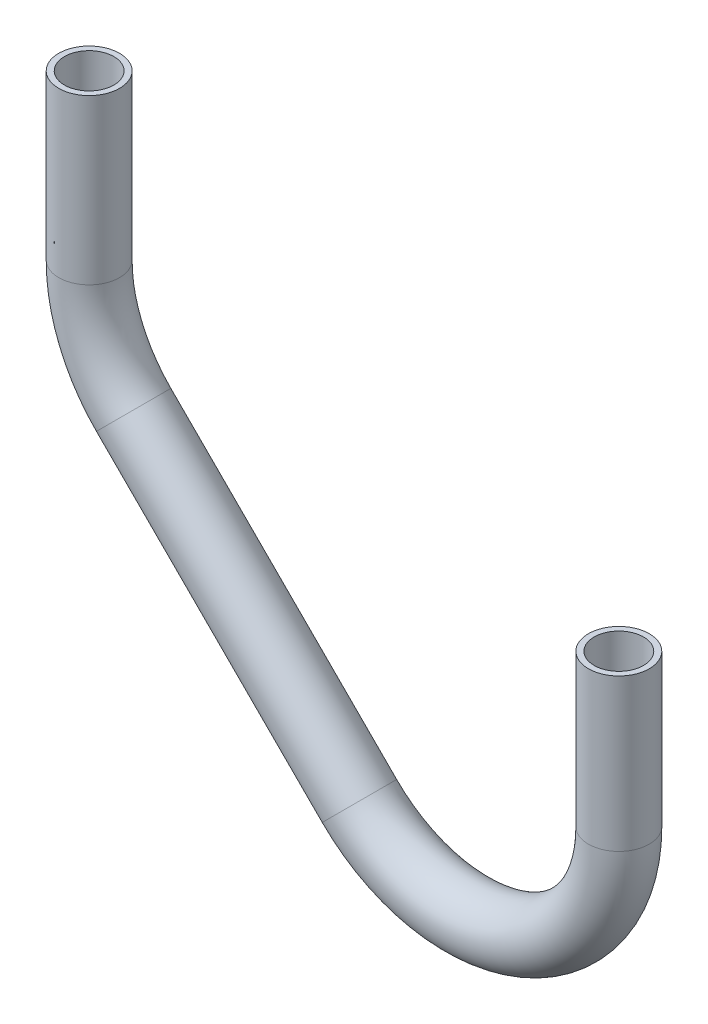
ISO-10303-21;
HEADER;
FILE_DESCRIPTION(('STEP AP214'),'2;1');
FILE_NAME('part.step','',(''),(''),'','','');
FILE_SCHEMA(('AUTOMOTIVE_DESIGN { 1 0 10303 214 1 1 1 1 }'));
ENDSEC;
DATA;
#1=APPLICATION_CONTEXT('core data for automotive mechanical design processes');
#2=APPLICATION_PROTOCOL_DEFINITION('international standard','automotive_design',2000,#1);
#3=PRODUCT_CONTEXT('',#1,'mechanical');
#4=PRODUCT('Part','Part','',(#3));
#5=PRODUCT_RELATED_PRODUCT_CATEGORY('part','',(#4));
#6=PRODUCT_DEFINITION_FORMATION('','',#4);
#7=PRODUCT_DEFINITION_CONTEXT('part definition',#1,'design');
#8=PRODUCT_DEFINITION('design','',#6,#7);
#9=PRODUCT_DEFINITION_SHAPE('','',#8);
#10=(LENGTH_UNIT() NAMED_UNIT(*) SI_UNIT(.MILLI.,.METRE.));
#11=(NAMED_UNIT(*) PLANE_ANGLE_UNIT() SI_UNIT($,.RADIAN.));
#12=(NAMED_UNIT(*) SI_UNIT($,.STERADIAN.) SOLID_ANGLE_UNIT());
#13=UNCERTAINTY_MEASURE_WITH_UNIT(LENGTH_MEASURE(1.E-05),#10,'distance_accuracy_value','');
#14=(GEOMETRIC_REPRESENTATION_CONTEXT(3) GLOBAL_UNCERTAINTY_ASSIGNED_CONTEXT((#13)) GLOBAL_UNIT_ASSIGNED_CONTEXT((#10,
#11,#12)) REPRESENTATION_CONTEXT('',''));
#15=CARTESIAN_POINT('',(0.,0.,0.));
#16=DIRECTION('',(0.,0.,1.));
#17=DIRECTION('',(1.,0.,0.));
#18=AXIS2_PLACEMENT_3D('',#15,#16,#17);
#19=CARTESIAN_POINT('',(0.,0.,0.));
#20=DIRECTION('',(0.,-0.999999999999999,0.));
#21=DIRECTION('',(0.999999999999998,0.,0.));
#22=AXIS2_PLACEMENT_3D('',#19,#20,#21);
#23=CYLINDRICAL_SURFACE('',#22,4.7625);
#24=CARTESIAN_POINT('',(0.,-23.8124999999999,0.));
#25=DIRECTION('',(0.,1.,0.));
#26=DIRECTION('',(0.,0.,0.999999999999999));
#27=AXIS2_PLACEMENT_3D('',#24,#25,#26);
#28=CIRCLE('',#27,4.7625);
#29=CARTESIAN_POINT('',(4.76250000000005,-23.8124999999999,0.));
#30=VERTEX_POINT('',#29);
#31=EDGE_CURVE('E113',#30,#30,#28,.T.);
#32=ORIENTED_EDGE('',*,*,#31,.T.);
#33=EDGE_LOOP('',(#32));
#34=FACE_BOUND('',#33,.T.);
#35=CARTESIAN_POINT('',(0.,0.,0.));
#36=DIRECTION('',(0.,1.,0.));
#37=DIRECTION('',(0.,0.,0.999999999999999));
#38=AXIS2_PLACEMENT_3D('',#35,#36,#37);
#39=CIRCLE('',#38,4.7625);
#40=CARTESIAN_POINT('',(0.,0.,4.7625));
#41=VERTEX_POINT('',#40);
#42=EDGE_CURVE('E47',#41,#41,#39,.T.);
#43=ORIENTED_EDGE('',*,*,#42,.F.);
#44=EDGE_LOOP('',(#43));
#45=FACE_BOUND('',#44,.T.);
#46=ADVANCED_FACE('F32',(#34,#45),#23,.T.);
#47=CARTESIAN_POINT('',(-23.8125,-23.8125,0.));
#48=DIRECTION('',(0.,0.,-0.999999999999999));
#49=DIRECTION('',(-0.999999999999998,0.,0.));
#50=AXIS2_PLACEMENT_3D('',#47,#48,#49);
#51=TOROIDAL_SURFACE('',#50,23.8125,4.7625);
#52=CARTESIAN_POINT('',(-40.6504802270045,-40.6504802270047,0.));
#53=DIRECTION('',(0.707106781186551,-0.707106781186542,0.));
#54=DIRECTION('',(0.,0.,0.999999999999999));
#55=AXIS2_PLACEMENT_3D('',#52,#53,#54);
#56=CIRCLE('',#55,4.7625);
#57=CARTESIAN_POINT('',(-44.0180762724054,-44.0180762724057,0.));
#58=VERTEX_POINT('',#57);
#59=EDGE_CURVE('E116',#58,#58,#56,.T.);
#60=CARTESIAN_POINT('',(-23.8125,-23.8125,0.));
#61=DIRECTION('',(0.,0.,-0.999999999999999));
#62=DIRECTION('',(-0.999999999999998,0.,0.));
#63=AXIS2_PLACEMENT_3D('',#60,#61,#62);
#64=CIRCLE('',#63,28.575);
#65=EDGE_CURVE('',#30,#58,#64,.T.);
#66=ORIENTED_EDGE('',*,*,#31,.F.);
#67=ORIENTED_EDGE('',*,*,#59,.T.);
#68=ORIENTED_EDGE('',*,*,#65,.T.);
#69=ORIENTED_EDGE('',*,*,#65,.F.);
#70=EDGE_LOOP('',(#66,#68,#67,#69));
#71=FACE_BOUND('',#70,.T.);
#72=ADVANCED_FACE('F137',(#71),#51,.T.);
#73=CARTESIAN_POINT('',(-40.6504802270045,-40.6504802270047,0.));
#74=DIRECTION('',(-0.707106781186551,0.707106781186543,0.));
#75=DIRECTION('',(-0.707106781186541,-0.707106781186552,0.));
#76=AXIS2_PLACEMENT_3D('',#73,#74,#75);
#77=CYLINDRICAL_SURFACE('',#76,4.7625);
#78=CARTESIAN_POINT('',(-76.0373473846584,-5.26361306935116,0.));
#79=DIRECTION('',(0.707106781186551,-0.707106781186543,0.));
#80=DIRECTION('',(0.,0.,0.999999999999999));
#81=AXIS2_PLACEMENT_3D('',#78,#79,#80);
#82=CIRCLE('',#81,4.7625);
#83=CARTESIAN_POINT('',(-79.4049434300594,-8.63120911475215,0.));
#84=VERTEX_POINT('',#83);
#85=EDGE_CURVE('E118',#84,#84,#82,.T.);
#86=CARTESIAN_POINT('',(-79.4049434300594,-8.63120911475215,0.));
#87=CARTESIAN_POINT('',(-79.0363302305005,-8.99982231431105,0.));
#88=CARTESIAN_POINT('',(-78.6677170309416,-9.36843551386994,0.));
#89=CARTESIAN_POINT('',(-77.9304906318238,-10.1056619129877,0.));
#90=CARTESIAN_POINT('',(-77.5618774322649,-10.4742751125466,0.));
#91=CARTESIAN_POINT('',(-76.8246510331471,-11.2115015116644,0.));
#92=CARTESIAN_POINT('',(-76.4560378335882,-11.5801147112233,0.));
#93=CARTESIAN_POINT('',(-75.7188114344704,-12.3173411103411,0.));
#94=CARTESIAN_POINT('',(-75.3501982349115,-12.6859543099,0.));
#95=CARTESIAN_POINT('',(-74.6129718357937,-13.4231807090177,0.));
#96=CARTESIAN_POINT('',(-74.2443586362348,-13.7917939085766,0.));
#97=CARTESIAN_POINT('',(-73.507132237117,-14.5290203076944,0.));
#98=CARTESIAN_POINT('',(-73.1385190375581,-14.8976335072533,0.));
#99=CARTESIAN_POINT('',(-72.4012926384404,-15.6348599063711,0.));
#100=CARTESIAN_POINT('',(-72.0326794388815,-16.00347310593,0.));
#101=CARTESIAN_POINT('',(-71.2954530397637,-16.7406995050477,0.));
#102=CARTESIAN_POINT('',(-70.9268398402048,-17.1093127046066,0.));
#103=CARTESIAN_POINT('',(-70.189613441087,-17.8465391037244,0.));
#104=CARTESIAN_POINT('',(-69.8210002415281,-18.2151523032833,0.));
#105=CARTESIAN_POINT('',(-69.0837738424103,-18.9523787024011,0.));
#106=CARTESIAN_POINT('',(-68.7151606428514,-19.32099190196,0.));
#107=CARTESIAN_POINT('',(-67.9779342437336,-20.0582183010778,0.));
#108=CARTESIAN_POINT('',(-67.6093210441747,-20.4268315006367,0.));
#109=CARTESIAN_POINT('',(-66.8720946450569,-21.1640578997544,0.));
#110=CARTESIAN_POINT('',(-66.503481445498,-21.5326710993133,0.));
#111=CARTESIAN_POINT('',(-65.7662550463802,-22.2698974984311,0.));
#112=CARTESIAN_POINT('',(-65.3976418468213,-22.63851069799,0.));
#113=CARTESIAN_POINT('',(-64.6604154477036,-23.3757370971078,0.));
#114=CARTESIAN_POINT('',(-64.2918022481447,-23.7443502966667,0.));
#115=CARTESIAN_POINT('',(-63.5545758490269,-24.4815766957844,0.));
#116=CARTESIAN_POINT('',(-63.185962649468,-24.8501898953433,0.));
#117=CARTESIAN_POINT('',(-62.4487362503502,-25.5874162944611,0.));
#118=CARTESIAN_POINT('',(-62.0801230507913,-25.95602949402,0.));
#119=CARTESIAN_POINT('',(-61.3428966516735,-26.6932558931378,0.));
#120=CARTESIAN_POINT('',(-60.9742834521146,-27.0618690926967,0.));
#121=CARTESIAN_POINT('',(-60.2370570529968,-27.7990954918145,0.));
#122=CARTESIAN_POINT('',(-59.8684438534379,-28.1677086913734,0.));
#123=CARTESIAN_POINT('',(-59.1312174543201,-28.9049350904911,0.));
#124=CARTESIAN_POINT('',(-58.7626042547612,-29.27354829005,0.));
#125=CARTESIAN_POINT('',(-58.0253778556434,-30.0107746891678,0.));
#126=CARTESIAN_POINT('',(-57.6567646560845,-30.3793878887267,0.));
#127=CARTESIAN_POINT('',(-56.9195382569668,-31.1166142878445,0.));
#128=CARTESIAN_POINT('',(-56.5509250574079,-31.4852274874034,0.));
#129=CARTESIAN_POINT('',(-55.8136986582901,-32.2224538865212,0.));
#130=CARTESIAN_POINT('',(-55.4450854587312,-32.59106708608,0.));
#131=CARTESIAN_POINT('',(-54.7078590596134,-33.3282934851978,0.));
#132=CARTESIAN_POINT('',(-54.3392458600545,-33.6969066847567,0.));
#133=CARTESIAN_POINT('',(-53.6020194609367,-34.4341330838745,0.));
#134=CARTESIAN_POINT('',(-53.2334062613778,-34.8027462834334,0.));
#135=CARTESIAN_POINT('',(-52.49617986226,-35.5399726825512,0.));
#136=CARTESIAN_POINT('',(-52.1275666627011,-35.9085858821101,0.));
#137=CARTESIAN_POINT('',(-51.3903402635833,-36.6458122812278,0.));
#138=CARTESIAN_POINT('',(-51.0217270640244,-37.0144254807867,0.));
#139=CARTESIAN_POINT('',(-50.2845006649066,-37.7516518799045,0.));
#140=CARTESIAN_POINT('',(-49.9158874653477,-38.1202650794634,0.));
#141=CARTESIAN_POINT('',(-49.17866106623,-38.8574914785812,0.));
#142=CARTESIAN_POINT('',(-48.8100478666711,-39.2261046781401,0.));
#143=CARTESIAN_POINT('',(-48.0728214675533,-39.9633310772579,0.));
#144=CARTESIAN_POINT('',(-47.7042082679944,-40.3319442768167,0.));
#145=CARTESIAN_POINT('',(-46.9669818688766,-41.0691706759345,0.));
#146=CARTESIAN_POINT('',(-46.5983686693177,-41.4377838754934,0.));
#147=CARTESIAN_POINT('',(-45.8611422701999,-42.1750102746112,0.));
#148=CARTESIAN_POINT('',(-45.492529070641,-42.5436234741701,0.));
#149=CARTESIAN_POINT('',(-44.7553026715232,-43.2808498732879,0.));
#150=CARTESIAN_POINT('',(-44.3866894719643,-43.6494630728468,0.));
#151=CARTESIAN_POINT('',(-44.0180762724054,-44.0180762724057,0.));
#152=B_SPLINE_CURVE_WITH_KNOTS('',3,(#86,#87,#88,#89,#90,#91,#92,#93,#94,#95,#96,#97,#98,#99,
#100,#101,#102,#103,#104,#105,#106,#107,#108,#109,#110,#111,#112,#113,#114,#115,#116,#117,#118,
#119,#120,#121,#122,#123,#124,#125,#126,#127,#128,#129,#130,#131,#132,#133,#134,#135,#136,#137,
#138,#139,#140,#141,#142,#143,#144,#145,#146,#147,#148,#149,#150,#151),.UNSPECIFIED.,.F.,.F.,(4,
2,2,2,2,2,2,2,2,2,2,2,2,2,2,2,2,2,2,2,2,2,2,2,2,2,2,2,2,2,2,2,4),(0.,1.56389335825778,
3.12778671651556,4.69168007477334,6.25557343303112,7.8194667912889,9.38336014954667,
10.9472535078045,12.5111468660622,14.07504022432,15.6389335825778,17.2028269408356,
18.7667202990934,20.3306136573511,21.8945070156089,23.4584003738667,25.0222937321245,
26.5861870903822,28.15008044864,29.7139738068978,31.2778671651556,32.8417605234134,
34.4056538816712,35.9695472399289,37.5334405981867,39.0973339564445,40.6612273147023,
42.2251206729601,43.7890140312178,45.3529073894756,46.9168007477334,48.4806941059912,
50.0445874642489),.UNSPECIFIED.);
#153=EDGE_CURVE('BSEAM133',#84,#58,#152,.T.);
#154=ORIENTED_EDGE('',*,*,#85,.T.);
#155=ORIENTED_EDGE('',*,*,#59,.F.);
#156=ORIENTED_EDGE('',*,*,#153,.T.);
#157=ORIENTED_EDGE('',*,*,#153,.F.);
#158=EDGE_LOOP('',(#154,#156,#155,#157));
#159=FACE_BOUND('',#158,.T.);
#160=ADVANCED_FACE('F133',(#159),#77,.T.);
#161=CARTESIAN_POINT('',(-59.1993671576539,11.5743671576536,0.));
#162=DIRECTION('',(0.,0.,-0.999999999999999));
#163=DIRECTION('',(-0.999999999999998,0.,0.));
#164=AXIS2_PLACEMENT_3D('',#161,#162,#163);
#165=TOROIDAL_SURFACE('',#164,23.8125,4.7625);
#166=CARTESIAN_POINT('',(-83.0118671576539,11.5743671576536,0.));
#167=DIRECTION('',(0.,-0.999999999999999,0.));
#168=DIRECTION('',(0.,0.,0.999999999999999));
#169=AXIS2_PLACEMENT_3D('',#166,#167,#168);
#170=CIRCLE('',#169,4.7625);
#171=CARTESIAN_POINT('',(-87.7743671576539,11.5743671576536,0.));
#172=VERTEX_POINT('',#171);
#173=EDGE_CURVE('E36',#172,#172,#170,.T.);
#174=CARTESIAN_POINT('',(-59.1993671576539,11.5743671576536,0.));
#175=DIRECTION('',(0.,0.,-0.999999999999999));
#176=DIRECTION('',(-0.999999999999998,0.,0.));
#177=AXIS2_PLACEMENT_3D('',#174,#175,#176);
#178=CIRCLE('',#177,28.575);
#179=EDGE_CURVE('',#84,#172,#178,.T.);
#180=ORIENTED_EDGE('',*,*,#85,.F.);
#181=ORIENTED_EDGE('',*,*,#173,.T.);
#182=ORIENTED_EDGE('',*,*,#179,.T.);
#183=ORIENTED_EDGE('',*,*,#179,.F.);
#184=EDGE_LOOP('',(#180,#182,#181,#183));
#185=FACE_BOUND('',#184,.T.);
#186=ADVANCED_FACE('F125',(#185),#165,.T.);
#187=CARTESIAN_POINT('',(-83.0118671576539,11.5743671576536,0.));
#188=DIRECTION('',(0.,1.,0.));
#189=DIRECTION('',(0.,0.,0.999999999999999));
#190=AXIS2_PLACEMENT_3D('',#187,#188,#189);
#191=CYLINDRICAL_SURFACE('',#190,4.7625);
#192=CARTESIAN_POINT('',(-83.0118671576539,37.2643071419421,0.));
#193=DIRECTION('',(0.,-0.999999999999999,0.));
#194=DIRECTION('',(0.,0.,0.999999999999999));
#195=AXIS2_PLACEMENT_3D('',#192,#193,#194);
#196=CIRCLE('',#195,4.7625);
#197=CARTESIAN_POINT('',(-83.0118671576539,37.2643071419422,4.76250000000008));
#198=VERTEX_POINT('',#197);
#199=EDGE_CURVE('E52',#198,#198,#196,.T.);
#200=ORIENTED_EDGE('',*,*,#199,.T.);
#201=EDGE_LOOP('',(#200));
#202=FACE_BOUND('',#201,.T.);
#203=ORIENTED_EDGE('',*,*,#173,.F.);
#204=EDGE_LOOP('',(#203));
#205=FACE_BOUND('',#204,.T.);
#206=ADVANCED_FACE('F34',(#202,#205),#191,.T.);
#207=CARTESIAN_POINT('',(0.,0.,0.));
#208=DIRECTION('',(0.,1.,0.));
#209=DIRECTION('',(0.,0.,0.999999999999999));
#210=AXIS2_PLACEMENT_3D('',#207,#208,#209);
#211=PLANE('',#210);
#212=CARTESIAN_POINT('',(0.,0.,0.));
#213=DIRECTION('',(0.,1.,0.));
#214=DIRECTION('',(0.,0.,0.999999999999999));
#215=AXIS2_PLACEMENT_3D('',#212,#213,#214);
#216=CIRCLE('',#215,3.8735);
#217=CARTESIAN_POINT('',(0.,0.,3.87349999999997));
#218=VERTEX_POINT('',#217);
#219=EDGE_CURVE('E100',#218,#218,#216,.F.);
#220=ORIENTED_EDGE('',*,*,#219,.T.);
#221=EDGE_LOOP('',(#220));
#222=FACE_BOUND('',#221,.T.);
#223=ORIENTED_EDGE('',*,*,#42,.T.);
#224=EDGE_LOOP('',(#223));
#225=FACE_BOUND('',#224,.T.);
#226=ADVANCED_FACE('F65',(#222,#225),#211,.T.);
#227=CARTESIAN_POINT('',(-83.0118671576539,37.2643071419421,0.));
#228=DIRECTION('',(0.,-0.999999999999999,0.));
#229=DIRECTION('',(0.,0.,0.999999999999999));
#230=AXIS2_PLACEMENT_3D('',#227,#228,#229);
#231=PLANE('',#230);
#232=CARTESIAN_POINT('',(-83.0118671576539,37.2643071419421,0.));
#233=DIRECTION('',(0.,-0.999999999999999,0.));
#234=DIRECTION('',(0.,0.,0.999999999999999));
#235=AXIS2_PLACEMENT_3D('',#232,#233,#234);
#236=CIRCLE('',#235,3.8735);
#237=CARTESIAN_POINT('',(-83.0118671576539,37.2643071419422,3.87350000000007));
#238=VERTEX_POINT('',#237);
#239=EDGE_CURVE('E11',#238,#238,#236,.F.);
#240=ORIENTED_EDGE('',*,*,#239,.F.);
#241=EDGE_LOOP('',(#240));
#242=FACE_BOUND('',#241,.T.);
#243=ORIENTED_EDGE('',*,*,#199,.F.);
#244=EDGE_LOOP('',(#243));
#245=FACE_BOUND('',#244,.T.);
#246=ADVANCED_FACE('F62',(#242,#245),#231,.F.);
#247=CARTESIAN_POINT('',(0.,0.,0.));
#248=DIRECTION('',(0.,-0.999999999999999,0.));
#249=DIRECTION('',(0.999999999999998,0.,0.));
#250=AXIS2_PLACEMENT_3D('',#247,#248,#249);
#251=CYLINDRICAL_SURFACE('',#250,3.8735);
#252=CARTESIAN_POINT('',(0.,-23.8124999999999,0.));
#253=DIRECTION('',(0.,1.,0.));
#254=DIRECTION('',(0.,0.,0.999999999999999));
#255=AXIS2_PLACEMENT_3D('',#252,#253,#254);
#256=CIRCLE('',#255,3.8735);
#257=CARTESIAN_POINT('',(3.87350000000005,-23.8124999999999,0.));
#258=VERTEX_POINT('',#257);
#259=EDGE_CURVE('E99',#258,#258,#256,.F.);
#260=ORIENTED_EDGE('',*,*,#259,.T.);
#261=EDGE_LOOP('',(#260));
#262=FACE_BOUND('',#261,.T.);
#263=ORIENTED_EDGE('',*,*,#219,.F.);
#264=EDGE_LOOP('',(#263));
#265=FACE_BOUND('',#264,.T.);
#266=ADVANCED_FACE('F64',(#262,#265),#251,.F.);
#267=CARTESIAN_POINT('',(-23.8125,-23.8125,0.));
#268=DIRECTION('',(0.,0.,-0.999999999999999));
#269=DIRECTION('',(-0.999999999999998,0.,0.));
#270=AXIS2_PLACEMENT_3D('',#267,#268,#269);
#271=TOROIDAL_SURFACE('',#270,23.8125,3.8735);
#272=CARTESIAN_POINT('',(-40.6504802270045,-40.6504802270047,0.));
#273=DIRECTION('',(0.707106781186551,-0.707106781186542,0.));
#274=DIRECTION('',(0.,0.,0.999999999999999));
#275=AXIS2_PLACEMENT_3D('',#272,#273,#274);
#276=CIRCLE('',#275,3.8735);
#277=CARTESIAN_POINT('',(-43.3894583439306,-43.3894583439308,0.));
#278=VERTEX_POINT('',#277);
#279=EDGE_CURVE('E96',#278,#278,#276,.F.);
#280=CARTESIAN_POINT('',(-23.8125,-23.8125,0.));
#281=DIRECTION('',(0.,0.,-0.999999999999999));
#282=DIRECTION('',(-0.999999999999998,0.,0.));
#283=AXIS2_PLACEMENT_3D('',#280,#281,#282);
#284=CIRCLE('',#283,27.686);
#285=EDGE_CURVE('',#258,#278,#284,.T.);
#286=ORIENTED_EDGE('',*,*,#259,.F.);
#287=ORIENTED_EDGE('',*,*,#279,.T.);
#288=ORIENTED_EDGE('',*,*,#285,.T.);
#289=ORIENTED_EDGE('',*,*,#285,.F.);
#290=EDGE_LOOP('',(#286,#288,#287,#289));
#291=FACE_BOUND('',#290,.T.);
#292=ADVANCED_FACE('F71',(#291),#271,.F.);
#293=CARTESIAN_POINT('',(-40.6504802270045,-40.6504802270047,0.));
#294=DIRECTION('',(-0.707106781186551,0.707106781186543,0.));
#295=DIRECTION('',(-0.707106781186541,-0.707106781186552,0.));
#296=AXIS2_PLACEMENT_3D('',#293,#294,#295);
#297=CYLINDRICAL_SURFACE('',#296,3.8735);
#298=CARTESIAN_POINT('',(-76.0373473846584,-5.26361306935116,0.));
#299=DIRECTION('',(0.707106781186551,-0.707106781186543,0.));
#300=DIRECTION('',(0.,0.,0.999999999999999));
#301=AXIS2_PLACEMENT_3D('',#298,#299,#300);
#302=CIRCLE('',#301,3.8735);
#303=CARTESIAN_POINT('',(-78.7763255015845,-8.00259118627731,0.));
#304=VERTEX_POINT('',#303);
#305=EDGE_CURVE('E102',#304,#304,#302,.F.);
#306=CARTESIAN_POINT('',(-78.7763255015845,-8.00259118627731,0.));
#307=CARTESIAN_POINT('',(-78.4077123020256,-8.3712043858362,0.));
#308=CARTESIAN_POINT('',(-78.0390991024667,-8.7398175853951,0.));
#309=CARTESIAN_POINT('',(-77.3018727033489,-9.47704398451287,0.));
#310=CARTESIAN_POINT('',(-76.9332595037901,-9.84565718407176,0.));
#311=CARTESIAN_POINT('',(-76.1960331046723,-10.5828835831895,0.));
#312=CARTESIAN_POINT('',(-75.8274199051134,-10.9514967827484,0.));
#313=CARTESIAN_POINT('',(-75.0901935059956,-11.6887231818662,0.));
#314=CARTESIAN_POINT('',(-74.7215803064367,-12.0573363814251,0.));
#315=CARTESIAN_POINT('',(-73.9843539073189,-12.7945627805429,0.));
#316=CARTESIAN_POINT('',(-73.61574070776,-13.1631759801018,0.));
#317=CARTESIAN_POINT('',(-72.8785143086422,-13.9004023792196,0.));
#318=CARTESIAN_POINT('',(-72.5099011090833,-14.2690155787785,0.));
#319=CARTESIAN_POINT('',(-71.7726747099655,-15.0062419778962,0.));
#320=CARTESIAN_POINT('',(-71.4040615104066,-15.3748551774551,0.));
#321=CARTESIAN_POINT('',(-70.6668351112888,-16.1120815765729,0.));
#322=CARTESIAN_POINT('',(-70.2982219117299,-16.4806947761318,0.));
#323=CARTESIAN_POINT('',(-69.5609955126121,-17.2179211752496,0.));
#324=CARTESIAN_POINT('',(-69.1923823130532,-17.5865343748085,0.));
#325=CARTESIAN_POINT('',(-68.4551559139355,-18.3237607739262,0.));
#326=CARTESIAN_POINT('',(-68.0865427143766,-18.6923739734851,0.));
#327=CARTESIAN_POINT('',(-67.3493163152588,-19.4296003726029,0.));
#328=CARTESIAN_POINT('',(-66.9807031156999,-19.7982135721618,0.));
#329=CARTESIAN_POINT('',(-66.2434767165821,-20.5354399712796,0.));
#330=CARTESIAN_POINT('',(-65.8748635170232,-20.9040531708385,0.));
#331=CARTESIAN_POINT('',(-65.1376371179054,-21.6412795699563,0.));
#332=CARTESIAN_POINT('',(-64.7690239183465,-22.0098927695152,0.));
#333=CARTESIAN_POINT('',(-64.0317975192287,-22.7471191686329,0.));
#334=CARTESIAN_POINT('',(-63.6631843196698,-23.1157323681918,0.));
#335=CARTESIAN_POINT('',(-62.925957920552,-23.8529587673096,0.));
#336=CARTESIAN_POINT('',(-62.5573447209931,-24.2215719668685,0.));
#337=CARTESIAN_POINT('',(-61.8201183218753,-24.9587983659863,0.));
#338=CARTESIAN_POINT('',(-61.4515051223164,-25.3274115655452,0.));
#339=CARTESIAN_POINT('',(-60.7142787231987,-26.064637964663,0.));
#340=CARTESIAN_POINT('',(-60.3456655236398,-26.4332511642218,0.));
#341=CARTESIAN_POINT('',(-59.608439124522,-27.1704775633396,0.));
#342=CARTESIAN_POINT('',(-59.2398259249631,-27.5390907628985,0.));
#343=CARTESIAN_POINT('',(-58.5025995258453,-28.2763171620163,0.));
#344=CARTESIAN_POINT('',(-58.1339863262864,-28.6449303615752,0.));
#345=CARTESIAN_POINT('',(-57.3967599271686,-29.382156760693,0.));
#346=CARTESIAN_POINT('',(-57.0281467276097,-29.7507699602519,0.));
#347=CARTESIAN_POINT('',(-56.2909203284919,-30.4879963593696,0.));
#348=CARTESIAN_POINT('',(-55.922307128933,-30.8566095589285,0.));
#349=CARTESIAN_POINT('',(-55.1850807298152,-31.5938359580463,0.));
#350=CARTESIAN_POINT('',(-54.8164675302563,-31.9624491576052,0.));
#351=CARTESIAN_POINT('',(-54.0792411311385,-32.699675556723,0.));
#352=CARTESIAN_POINT('',(-53.7106279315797,-33.0682887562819,0.));
#353=CARTESIAN_POINT('',(-52.9734015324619,-33.8055151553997,0.));
#354=CARTESIAN_POINT('',(-52.604788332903,-34.1741283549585,0.));
#355=CARTESIAN_POINT('',(-51.8675619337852,-34.9113547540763,0.));
#356=CARTESIAN_POINT('',(-51.4989487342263,-35.2799679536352,0.));
#357=CARTESIAN_POINT('',(-50.7617223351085,-36.017194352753,0.));
#358=CARTESIAN_POINT('',(-50.3931091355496,-36.3858075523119,0.));
#359=CARTESIAN_POINT('',(-49.6558827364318,-37.1230339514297,0.));
#360=CARTESIAN_POINT('',(-49.2872695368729,-37.4916471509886,0.));
#361=CARTESIAN_POINT('',(-48.5500431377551,-38.2288735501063,0.));
#362=CARTESIAN_POINT('',(-48.1814299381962,-38.5974867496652,0.));
#363=CARTESIAN_POINT('',(-47.4442035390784,-39.334713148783,0.));
#364=CARTESIAN_POINT('',(-47.0755903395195,-39.7033263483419,0.));
#365=CARTESIAN_POINT('',(-46.3383639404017,-40.4405527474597,0.));
#366=CARTESIAN_POINT('',(-45.9697507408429,-40.8091659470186,0.));
#367=CARTESIAN_POINT('',(-45.2325243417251,-41.5463923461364,0.));
#368=CARTESIAN_POINT('',(-44.8639111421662,-41.9150055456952,0.));
#369=CARTESIAN_POINT('',(-44.1266847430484,-42.652231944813,0.));
#370=CARTESIAN_POINT('',(-43.7580715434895,-43.0208451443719,0.));
#371=CARTESIAN_POINT('',(-43.3894583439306,-43.3894583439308,0.));
#372=B_SPLINE_CURVE_WITH_KNOTS('',3,(#306,#307,#308,#309,#310,#311,#312,#313,#314,#315,#316,
#317,#318,#319,#320,#321,#322,#323,#324,#325,#326,#327,#328,#329,#330,#331,#332,#333,#334,#335,
#336,#337,#338,#339,#340,#341,#342,#343,#344,#345,#346,#347,#348,#349,#350,#351,#352,#353,#354,
#355,#356,#357,#358,#359,#360,#361,#362,#363,#364,#365,#366,#367,#368,#369,#370,#371),
.UNSPECIFIED.,.F.,.F.,(4,2,2,2,2,2,2,2,2,2,2,2,2,2,2,2,2,2,2,2,2,2,2,2,2,2,2,2,2,2,2,2,4),(0.,
1.56389335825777,3.12778671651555,4.69168007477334,6.25557343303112,7.8194667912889,
9.38336014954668,10.9472535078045,12.5111468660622,14.07504022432,15.6389335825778,
17.2028269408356,18.7667202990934,20.3306136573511,21.8945070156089,23.4584003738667,
25.0222937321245,26.5861870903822,28.15008044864,29.7139738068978,31.2778671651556,
32.8417605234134,34.4056538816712,35.9695472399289,37.5334405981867,39.0973339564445,
40.6612273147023,42.2251206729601,43.7890140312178,45.3529073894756,46.9168007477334,
48.4806941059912,50.0445874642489),.UNSPECIFIED.);
#373=EDGE_CURVE('BSEAM82',#304,#278,#372,.T.);
#374=ORIENTED_EDGE('',*,*,#305,.T.);
#375=ORIENTED_EDGE('',*,*,#279,.F.);
#376=ORIENTED_EDGE('',*,*,#373,.T.);
#377=ORIENTED_EDGE('',*,*,#373,.F.);
#378=EDGE_LOOP('',(#374,#376,#375,#377));
#379=FACE_BOUND('',#378,.T.);
#380=ADVANCED_FACE('F82',(#379),#297,.F.);
#381=CARTESIAN_POINT('',(-59.1993671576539,11.5743671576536,0.));
#382=DIRECTION('',(0.,0.,-0.999999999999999));
#383=DIRECTION('',(-0.999999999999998,0.,0.));
#384=AXIS2_PLACEMENT_3D('',#381,#382,#383);
#385=TOROIDAL_SURFACE('',#384,23.8125,3.8735);
#386=CARTESIAN_POINT('',(-83.0118671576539,11.5743671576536,0.));
#387=DIRECTION('',(0.,-0.999999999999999,0.));
#388=DIRECTION('',(0.,0.,0.999999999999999));
#389=AXIS2_PLACEMENT_3D('',#386,#387,#388);
#390=CIRCLE('',#389,3.8735);
#391=CARTESIAN_POINT('',(-86.8853671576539,11.5743671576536,0.));
#392=VERTEX_POINT('',#391);
#393=EDGE_CURVE('E41',#392,#392,#390,.F.);
#394=CARTESIAN_POINT('',(-59.1993671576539,11.5743671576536,0.));
#395=DIRECTION('',(0.,0.,-0.999999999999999));
#396=DIRECTION('',(-0.999999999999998,0.,0.));
#397=AXIS2_PLACEMENT_3D('',#394,#395,#396);
#398=CIRCLE('',#397,27.686);
#399=EDGE_CURVE('',#304,#392,#398,.T.);
#400=ORIENTED_EDGE('',*,*,#305,.F.);
#401=ORIENTED_EDGE('',*,*,#393,.T.);
#402=ORIENTED_EDGE('',*,*,#399,.T.);
#403=ORIENTED_EDGE('',*,*,#399,.F.);
#404=EDGE_LOOP('',(#400,#402,#401,#403));
#405=FACE_BOUND('',#404,.T.);
#406=ADVANCED_FACE('F78',(#405),#385,.F.);
#407=CARTESIAN_POINT('',(-83.0118671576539,11.5743671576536,0.));
#408=DIRECTION('',(0.,1.,0.));
#409=DIRECTION('',(0.,0.,0.999999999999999));
#410=AXIS2_PLACEMENT_3D('',#407,#408,#409);
#411=CYLINDRICAL_SURFACE('',#410,3.8735);
#412=ORIENTED_EDGE('',*,*,#239,.T.);
#413=EDGE_LOOP('',(#412));
#414=FACE_BOUND('',#413,.T.);
#415=ORIENTED_EDGE('',*,*,#393,.F.);
#416=EDGE_LOOP('',(#415));
#417=FACE_BOUND('',#416,.T.);
#418=ADVANCED_FACE('F59',(#414,#417),#411,.F.);
#419=CLOSED_SHELL('',(#46,#72,#160,#186,#206,#226,#246,#266,#292,#380,#406,#418));
#420=MANIFOLD_SOLID_BREP('B2',#419);
#421=ADVANCED_BREP_SHAPE_REPRESENTATION('',(#18,#420),#14);
#422=SHAPE_DEFINITION_REPRESENTATION(#9,#421);
ENDSEC;
END-ISO-10303-21;
